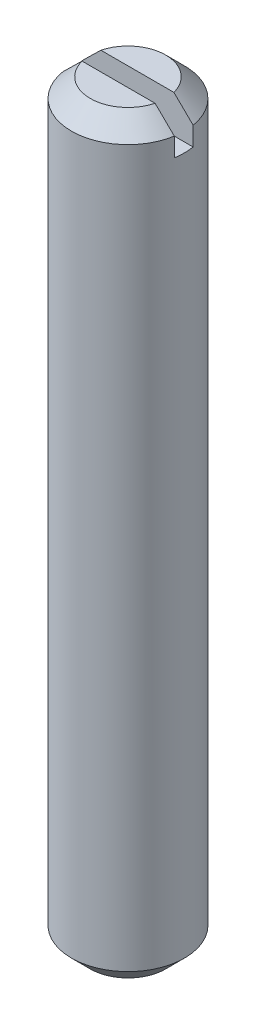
from build123d import *

# Parameters (mm, degrees)
ESQUISSE2_W             = 6
ESQUISSE2_H             = 1
ENL_V_MAT_EXTRU_1_DEPTH = 2


with BuildPart() as part:
    # Esquisse1 → Base-R_volution (revolve)
    with BuildSketch(Plane.XY, mode=Mode.PRIVATE) as base_r_volution_sk:
        Polygon((0, 0), (-2, 0), (-3, 1), (-3, 39), (-2, 40), (0, 40), align=None)
    revolve(base_r_volution_sk.sketch.rotate(Axis((0, 20, 0), (0, -1, 0)), 270), axis=Axis((0, 20, 0), (0, -1, 0)))

    # Esquisse2 → Enl_v. mat.-Extru.1 (cut)
    with BuildSketch(Plane(origin=(0, 40, 0), x_dir=(-1, 0, 0), z_dir=(0, 1, 0))):
        Rectangle(ESQUISSE2_W, ESQUISSE2_H)
    extrude(amount=-ENL_V_MAT_EXTRU_1_DEPTH, mode=Mode.SUBTRACT)


solid = part.part
